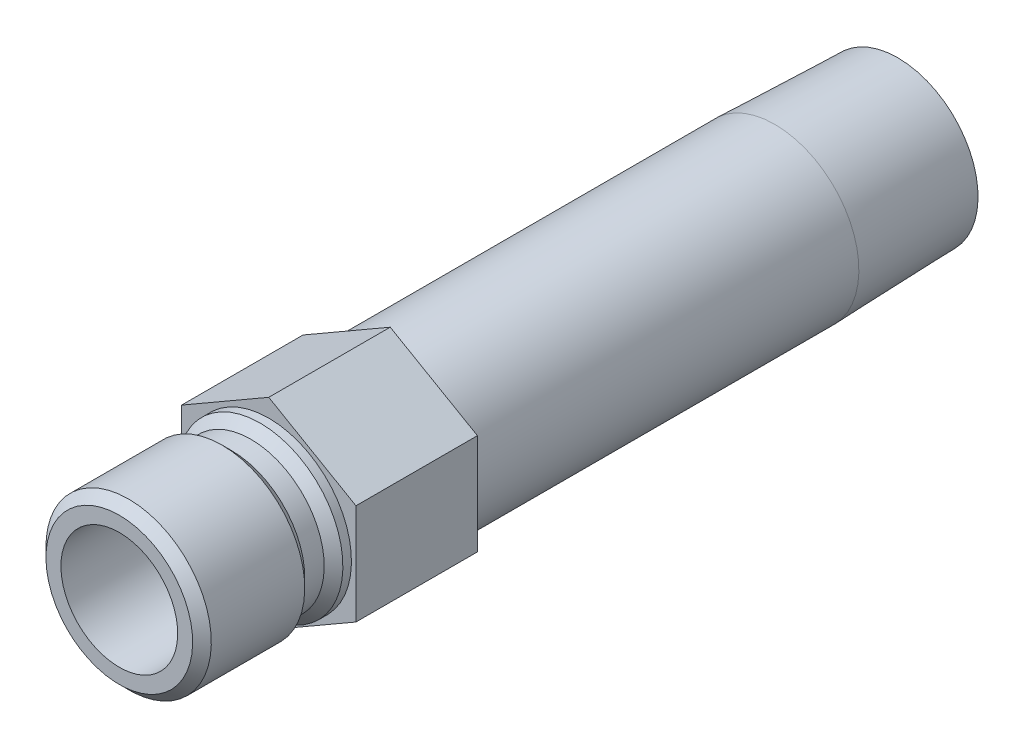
from build123d import *

# Parameters (mm, degrees)
SKETCH2_R           = 4.6228
BOSS_EXTRUDE1_DEPTH = 9.906


with BuildPart() as part:
    # Sketch1 → Revolve1 (revolve)
    with BuildSketch(Plane(origin=(0, 0, 0), x_dir=(0, 0, -1), z_dir=(1, 0, 0))):
        Polygon((-12.192, 4.7625), (-12.192, 5.9817), (-11.43, 6.7437), (-3.81, 6.7437), (-3.048, 5.9817), (-1.4605, 5.9817), (-0.6985, 6.7437), (0, 6.7437), (0, 6.858), (41.275, 6.858), (51.308, 6.544470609), (51.308, 4.6228), (0.074279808, 4.6228), (0, 4.7625), align=None)
    revolve(axis=Axis((0, 0, 0), (0, 0, 1)))

    # Sketch2 → Boss-Extrude1 (add)
    with BuildSketch(Plane.XY):
        Polygon((-7.112, 4.106115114), (-7.112, -4.106115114), (0, -8.212230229), (7.112, -4.106115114), (7.112, 4.106115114), (0, 8.212230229), align=None)
        with Locations(Location((0, 0, 0), (0, 0, 90))):
            Circle(SKETCH2_R, mode=Mode.SUBTRACT)
    extrude(amount=-BOSS_EXTRUDE1_DEPTH)


solid = part.part
